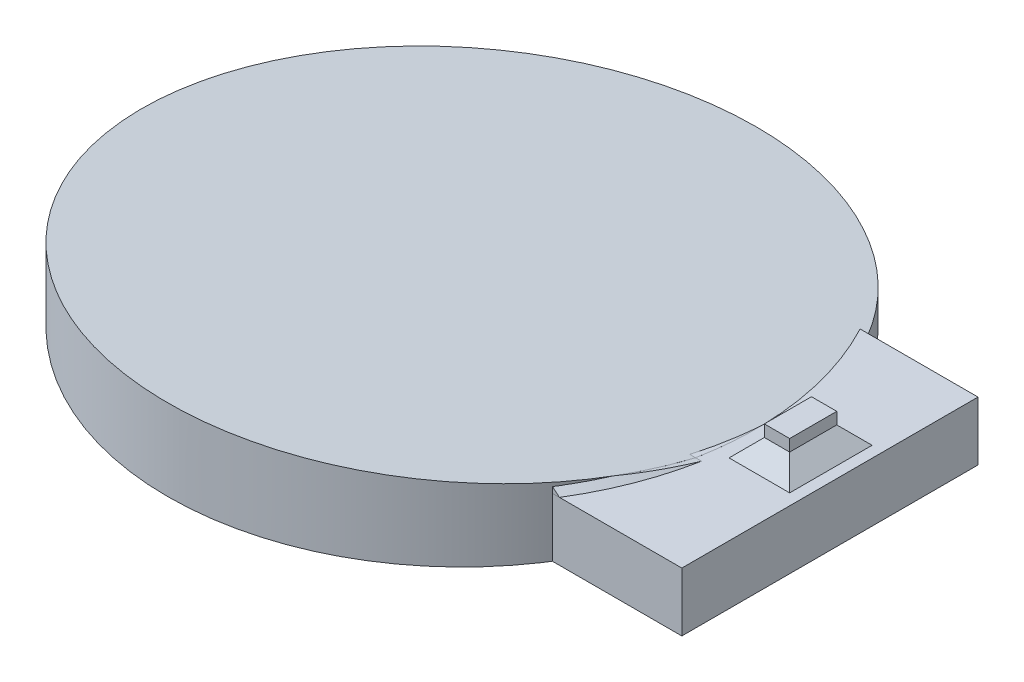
ISO-10303-21;
HEADER;
FILE_DESCRIPTION(('STEP AP214'),'2;1');
FILE_NAME('part.step','',(''),(''),'','','');
FILE_SCHEMA(('AUTOMOTIVE_DESIGN { 1 0 10303 214 1 1 1 1 }'));
ENDSEC;
DATA;
#1=APPLICATION_CONTEXT('core data for automotive mechanical design processes');
#2=APPLICATION_PROTOCOL_DEFINITION('international standard','automotive_design',2000,#1);
#3=PRODUCT_CONTEXT('',#1,'mechanical');
#4=PRODUCT('Part','Part','',(#3));
#5=PRODUCT_RELATED_PRODUCT_CATEGORY('part','',(#4));
#6=PRODUCT_DEFINITION_FORMATION('','',#4);
#7=PRODUCT_DEFINITION_CONTEXT('part definition',#1,'design');
#8=PRODUCT_DEFINITION('design','',#6,#7);
#9=PRODUCT_DEFINITION_SHAPE('','',#8);
#10=(LENGTH_UNIT() NAMED_UNIT(*) SI_UNIT(.MILLI.,.METRE.));
#11=(NAMED_UNIT(*) PLANE_ANGLE_UNIT() SI_UNIT($,.RADIAN.));
#12=(NAMED_UNIT(*) SI_UNIT($,.STERADIAN.) SOLID_ANGLE_UNIT());
#13=UNCERTAINTY_MEASURE_WITH_UNIT(LENGTH_MEASURE(1.E-05),#10,'distance_accuracy_value','');
#14=(GEOMETRIC_REPRESENTATION_CONTEXT(3) GLOBAL_UNCERTAINTY_ASSIGNED_CONTEXT((#13)) GLOBAL_UNIT_ASSIGNED_CONTEXT((#10,
#11,#12)) REPRESENTATION_CONTEXT('',''));
#15=CARTESIAN_POINT('',(0.,0.,0.));
#16=DIRECTION('',(0.,0.,1.));
#17=DIRECTION('',(1.,0.,0.));
#18=AXIS2_PLACEMENT_3D('',#15,#16,#17);
#19=CARTESIAN_POINT('',(177.768283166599,13.801824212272,50.));
#20=DIRECTION('',(0.,0.995639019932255,-0.0932895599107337));
#21=DIRECTION('',(0.,0.0932895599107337,0.995639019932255));
#22=AXIS2_PLACEMENT_3D('',#19,#20,#21);
#23=PLANE('',#22);
#24=DIRECTION('',(1.,0.,0.));
#25=VECTOR('',#24,1.);
#26=CARTESIAN_POINT('',(177.768283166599,10.,9.42477876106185));
#27=LINE('',#26,#25);
#28=CARTESIAN_POINT('',(49.1037019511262,10.,9.42477876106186));
#29=VERTEX_POINT('',#28);
#30=CARTESIAN_POINT('',(50.1215876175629,10.,9.42477876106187));
#31=VERTEX_POINT('',#30);
#32=EDGE_CURVE('E66',#29,#31,#27,.T.);
#33=ORIENTED_EDGE('',*,*,#32,.F.);
#34=CARTESIAN_POINT('',(0.,9.11691542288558,0.));
#35=DIRECTION('',(0.,0.995639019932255,-0.0932895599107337));
#36=DIRECTION('',(0.,-0.0932895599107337,-0.995639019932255));
#37=AXIS2_PLACEMENT_3D('',#34,#35,#36);
#38=ELLIPSE('',#37,50.2190040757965,50.);
#39=CARTESIAN_POINT('',(45.7831488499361,11.,20.0973451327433));
#40=VERTEX_POINT('',#39);
#41=EDGE_CURVE('E79',#40,#29,#38,.T.);
#42=ORIENTED_EDGE('',*,*,#41,.F.);
#43=CARTESIAN_POINT('',(0.,8.65738135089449,-4.90440788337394));
#44=DIRECTION('',(0.,0.995639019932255,-0.0932895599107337));
#45=DIRECTION('',(0.,-0.0932895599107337,-0.995639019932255));
#46=AXIS2_PLACEMENT_3D('',#43,#44,#45);
#47=ELLIPSE('',#46,52.5718835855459,52.1123450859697);
#48=EDGE_CURVE('E12',#40,#31,#47,.T.);
#49=ORIENTED_EDGE('',*,*,#48,.T.);
#50=EDGE_LOOP('',(#33,#42,#49));
#51=FACE_BOUND('',#50,.T.);
#52=ADVANCED_FACE('F44',(#51),#23,.T.);
#53=CARTESIAN_POINT('',(64.1693493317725,10.,26.8266510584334));
#54=DIRECTION('',(0.,0.,-1.));
#55=DIRECTION('',(-1.,0.,0.));
#56=AXIS2_PLACEMENT_3D('',#53,#54,#55);
#57=PLANE('',#56);
#58=DIRECTION('',(0.,-1.,0.));
#59=VECTOR('',#58,1.);
#60=CARTESIAN_POINT('',(42.1939663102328,15.,26.8266510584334));
#61=LINE('',#60,#59);
#62=CARTESIAN_POINT('',(42.1939663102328,10.,26.8266510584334));
#63=VERTEX_POINT('',#62);
#64=CARTESIAN_POINT('',(42.1939663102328,11.,26.8266510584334));
#65=VERTEX_POINT('',#64);
#66=EDGE_CURVE('E58',#63,#65,#61,.F.);
#67=ORIENTED_EDGE('',*,*,#66,.F.);
#68=DIRECTION('',(1.,0.,0.));
#69=VECTOR('',#68,1.);
#70=CARTESIAN_POINT('',(64.1693493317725,10.,26.8266510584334));
#71=LINE('',#70,#69);
#72=CARTESIAN_POINT('',(43.3743102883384,10.,26.8266510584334));
#73=VERTEX_POINT('',#72);
#74=EDGE_CURVE('E80',#63,#73,#71,.T.);
#75=ORIENTED_EDGE('',*,*,#74,.T.);
#76=CARTESIAN_POINT('',(43.3743102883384,10.,26.8266510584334));
#77=CARTESIAN_POINT('',(43.1779063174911,10.1670444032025,26.8266510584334));
#78=CARTESIAN_POINT('',(42.9813423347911,10.3338999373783,26.8266510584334));
#79=CARTESIAN_POINT('',(42.587894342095,10.6672332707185,26.8266510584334));
#80=CARTESIAN_POINT('',(42.3910103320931,10.8337110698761,26.8266510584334));
#81=CARTESIAN_POINT('',(42.1939663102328,11.,26.8266510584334));
#82=B_SPLINE_CURVE_WITH_KNOTS('',3,(#76,#77,#78,#79,#80,#81),.UNSPECIFIED.,.F.,.F.,(4,2,4),(0.,
0.773500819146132,1.54700165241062),.UNSPECIFIED.);
#83=EDGE_CURVE('E51',#73,#65,#82,.T.);
#84=ORIENTED_EDGE('',*,*,#83,.T.);
#85=EDGE_LOOP('',(#67,#75,#84));
#86=FACE_BOUND('',#85,.T.);
#87=ADVANCED_FACE('F89',(#86),#57,.F.);
#88=CARTESIAN_POINT('',(0.,10.,0.));
#89=DIRECTION('',(0.,-1.,0.));
#90=DIRECTION('',(0.,0.,-1.));
#91=AXIS2_PLACEMENT_3D('',#88,#89,#90);
#92=CONICAL_SURFACE('',#91,51.,0.785398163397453);
#93=ORIENTED_EDGE('',*,*,#48,.F.);
#94=CARTESIAN_POINT('',(0.,11.,0.));
#95=DIRECTION('',(0.,1.,0.));
#96=DIRECTION('',(0.,0.,1.));
#97=AXIS2_PLACEMENT_3D('',#94,#95,#96);
#98=CIRCLE('',#97,50.);
#99=EDGE_CURVE('E96',#65,#40,#98,.T.);
#100=ORIENTED_EDGE('',*,*,#99,.F.);
#101=ORIENTED_EDGE('',*,*,#83,.F.);
#102=CARTESIAN_POINT('',(0.,10.,0.));
#103=DIRECTION('',(0.,1.,0.));
#104=DIRECTION('',(0.,0.,1.));
#105=AXIS2_PLACEMENT_3D('',#102,#103,#104);
#106=CIRCLE('',#105,51.);
#107=EDGE_CURVE('E85',#31,#73,#106,.F.);
#108=ORIENTED_EDGE('',*,*,#107,.F.);
#109=EDGE_LOOP('',(#93,#100,#101,#108));
#110=FACE_BOUND('',#109,.T.);
#111=ADVANCED_FACE('F102',(#110),#92,.T.);
#112=CARTESIAN_POINT('',(0.,15.,0.));
#113=DIRECTION('',(0.,-1.,0.));
#114=DIRECTION('',(0.,0.,-1.));
#115=AXIS2_PLACEMENT_3D('',#112,#113,#114);
#116=CYLINDRICAL_SURFACE('',#115,50.);
#117=ORIENTED_EDGE('',*,*,#66,.T.);
#118=ORIENTED_EDGE('',*,*,#99,.T.);
#119=ORIENTED_EDGE('',*,*,#41,.T.);
#120=CARTESIAN_POINT('',(0.,10.,0.));
#121=DIRECTION('',(0.,1.,0.));
#122=DIRECTION('',(0.,0.,1.));
#123=AXIS2_PLACEMENT_3D('',#120,#121,#122);
#124=CIRCLE('',#123,50.);
#125=EDGE_CURVE('E75',#29,#63,#124,.F.);
#126=ORIENTED_EDGE('',*,*,#125,.T.);
#127=EDGE_LOOP('',(#117,#118,#119,#126));
#128=FACE_BOUND('',#127,.T.);
#129=ADVANCED_FACE('F77',(#128),#116,.F.);
#130=CARTESIAN_POINT('',(0.,10.,0.));
#131=DIRECTION('',(0.,1.,0.));
#132=DIRECTION('',(0.,0.,1.));
#133=AXIS2_PLACEMENT_3D('',#130,#131,#132);
#134=PLANE('',#133);
#135=ORIENTED_EDGE('',*,*,#32,.T.);
#136=ORIENTED_EDGE('',*,*,#107,.T.);
#137=ORIENTED_EDGE('',*,*,#74,.F.);
#138=ORIENTED_EDGE('',*,*,#125,.F.);
#139=EDGE_LOOP('',(#135,#136,#137,#138));
#140=FACE_BOUND('',#139,.T.);
#141=ADVANCED_FACE('F83',(#140),#134,.F.);
#142=CLOSED_SHELL('',(#52,#87,#111,#129,#141));
#143=MANIFOLD_SOLID_BREP('B2',#142);
#144=CARTESIAN_POINT('',(64.1693493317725,10.,-23.5001463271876));
#145=DIRECTION('',(0.,0.,1.));
#146=DIRECTION('',(1.,0.,0.));
#147=AXIS2_PLACEMENT_3D('',#144,#145,#146);
#148=PLANE('',#147);
#149=DIRECTION('',(0.,-1.,0.));
#150=VECTOR('',#149,1.);
#151=CARTESIAN_POINT('',(44.1332428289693,10.,-23.5001463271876));
#152=LINE('',#151,#150);
#153=CARTESIAN_POINT('',(44.1332428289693,7.94583982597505,-23.5001463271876));
#154=VERTEX_POINT('',#153);
#155=CARTESIAN_POINT('',(44.1332428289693,6.91499458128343,-23.5001463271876));
#156=VERTEX_POINT('',#155);
#157=EDGE_CURVE('E175',#154,#156,#152,.T.);
#158=ORIENTED_EDGE('',*,*,#157,.T.);
#159=DIRECTION('',(1.,0.,0.));
#160=VECTOR('',#159,1.);
#161=CARTESIAN_POINT('',(177.768283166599,6.91499458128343,-23.5001463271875));
#162=LINE('',#161,#160);
#163=CARTESIAN_POINT('',(42.9671919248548,6.91486611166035,-23.5015174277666));
#164=VERTEX_POINT('',#163);
#165=EDGE_CURVE('E207',#164,#156,#162,.T.);
#166=ORIENTED_EDGE('',*,*,#165,.F.);
#167=CARTESIAN_POINT('',(44.139200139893,7.94803674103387,-23.5001463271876));
#168=CARTESIAN_POINT('',(44.0903029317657,7.90499042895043,-23.5007119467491));
#169=CARTESIAN_POINT('',(44.0414097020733,7.8619386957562,-23.5012089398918));
#170=CARTESIAN_POINT('',(43.9436459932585,7.77583713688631,-23.5020655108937));
#171=CARTESIAN_POINT('',(43.8947755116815,7.73278731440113,-23.5024251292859));
#172=CARTESIAN_POINT('',(43.797057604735,7.64668958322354,-23.5030070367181));
#173=CARTESIAN_POINT('',(43.7482101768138,7.60364167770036,-23.5032293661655));
#174=CARTESIAN_POINT('',(43.6505386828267,7.51754778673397,-23.5035367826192));
#175=CARTESIAN_POINT('',(43.6017146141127,7.47450180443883,-23.5036219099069));
#176=CARTESIAN_POINT('',(43.5040901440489,7.38841176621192,-23.5036550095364));
#177=CARTESIAN_POINT('',(43.4552897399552,7.34536771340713,-23.5036030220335));
#178=CARTESIAN_POINT('',(43.3577129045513,7.25928154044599,-23.5033619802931));
#179=CARTESIAN_POINT('',(43.308936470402,7.21623942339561,-23.5031729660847));
#180=CARTESIAN_POINT('',(43.2114078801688,7.13015712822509,-23.5026579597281));
#181=CARTESIAN_POINT('',(43.1626557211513,7.08711695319,-23.5023320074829));
#182=CARTESIAN_POINT('',(43.0651759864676,7.00103854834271,-23.5015432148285));
#183=CARTESIAN_POINT('',(43.0164484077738,6.95800032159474,-23.5010804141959));
#184=CARTESIAN_POINT('',(42.9677262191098,6.91495683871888,-23.5005491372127));
#185=B_SPLINE_CURVE_WITH_KNOTS('',3,(#167,#168,#169,#170,#171,#172,#173,#174,#175,#176,#177,
#178,#179,#180,#181,#182,#183,#184),.UNSPECIFIED.,.F.,.F.,(4,2,2,2,2,2,2,2,4),(0.,
0.195443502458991,0.390829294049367,0.586157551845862,0.781428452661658,0.976642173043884,
1.17179888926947,1.36689877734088,1.56194201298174),.UNSPECIFIED.);
#186=EDGE_CURVE('E168',#164,#154,#185,.F.);
#187=ORIENTED_EDGE('',*,*,#186,.T.);
#188=EDGE_LOOP('',(#158,#166,#187));
#189=FACE_BOUND('',#188,.T.);
#190=ADVANCED_FACE('F157',(#189),#148,.F.);
#191=CARTESIAN_POINT('',(0.,10.,0.));
#192=DIRECTION('',(0.,1.,0.));
#193=DIRECTION('',(0.,0.,1.));
#194=AXIS2_PLACEMENT_3D('',#191,#192,#193);
#195=PLANE('',#194);
#196=DIRECTION('',(-1.,0.,0.));
#197=VECTOR('',#196,1.);
#198=CARTESIAN_POINT('',(0.,10.,9.42477876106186));
#199=LINE('',#198,#197);
#200=CARTESIAN_POINT('',(49.1037019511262,10.,9.42477876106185));
#201=VERTEX_POINT('',#200);
#202=CARTESIAN_POINT('',(48.1218807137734,10.0000864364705,9.42570126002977));
#203=VERTEX_POINT('',#202);
#204=EDGE_CURVE('E183',#201,#203,#199,.T.);
#205=ORIENTED_EDGE('',*,*,#204,.F.);
#206=CARTESIAN_POINT('',(0.,10.,0.));
#207=DIRECTION('',(0.,1.,0.));
#208=DIRECTION('',(0.,0.,1.));
#209=AXIS2_PLACEMENT_3D('',#206,#207,#208);
#210=CIRCLE('',#209,50.);
#211=CARTESIAN_POINT('',(49.9863240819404,10.,-1.16936084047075));
#212=VERTEX_POINT('',#211);
#213=EDGE_CURVE('E197',#212,#201,#210,.F.);
#214=ORIENTED_EDGE('',*,*,#213,.F.);
#215=CARTESIAN_POINT('',(48.1218822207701,10.0000857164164,9.4256935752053));
#216=CARTESIAN_POINT('',(48.2469062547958,10.0005990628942,8.99808269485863));
#217=CARTESIAN_POINT('',(48.3659370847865,10.0010084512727,8.56872311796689));
#218=CARTESIAN_POINT('',(48.5922828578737,10.0016500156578,7.70593175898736));
#219=CARTESIAN_POINT('',(48.6995718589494,10.0018818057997,7.27249316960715));
#220=CARTESIAN_POINT('',(48.9023915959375,10.002197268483,6.40184330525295));
#221=CARTESIAN_POINT('',(48.9978952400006,10.0022806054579,5.96462572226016));
#222=CARTESIAN_POINT('',(49.1771041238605,10.0023281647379,5.08671825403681));
#223=CARTESIAN_POINT('',(49.2607813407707,10.0022921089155,4.64602265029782));
#224=CARTESIAN_POINT('',(49.4162969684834,10.0021299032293,3.76146316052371));
#225=CARTESIAN_POINT('',(49.4881066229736,10.0020035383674,3.31759422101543));
#226=CARTESIAN_POINT('',(49.6198471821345,10.0016897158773,2.42699485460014));
#227=CARTESIAN_POINT('',(49.6797487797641,10.0015021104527,1.9802600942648));
#228=CARTESIAN_POINT('',(49.7876334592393,10.0010948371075,1.08423944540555));
#229=CARTESIAN_POINT('',(49.8355868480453,10.0008750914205,0.634949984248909));
#230=CARTESIAN_POINT('',(49.91953602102,10.0004324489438,-0.265868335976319));
#231=CARTESIAN_POINT('',(49.9555018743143,10.0002095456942,-0.717399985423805));
#232=CARTESIAN_POINT('',(49.9854317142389,10.,-1.16932908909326));
#233=B_SPLINE_CURVE_WITH_KNOTS('',3,(#215,#216,#217,#218,#219,#220,#221,#222,#223,#224,#225,
#226,#227,#228,#229,#230,#231,#232),.UNSPECIFIED.,.F.,.F.,(4,2,2,2,2,2,2,2,4),(0.,
1.3364918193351,2.67587924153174,4.01829041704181,5.36383095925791,6.71258553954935,
8.06461954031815,9.41998076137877,10.7787011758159),.UNSPECIFIED.);
#234=EDGE_CURVE('E42',#212,#203,#233,.F.);
#235=ORIENTED_EDGE('',*,*,#234,.T.);
#236=EDGE_LOOP('',(#205,#214,#235));
#237=FACE_BOUND('',#236,.T.);
#238=ADVANCED_FACE('F159',(#237),#195,.T.);
#239=CARTESIAN_POINT('',(47.7644780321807,10.1558328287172,11.0879149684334));
#240=CARTESIAN_POINT('',(50.6104779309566,9.01693759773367,-1.06701997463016));
#241=CARTESIAN_POINT('',(48.5430461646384,7.77961594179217,-14.2724174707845));
#242=CARTESIAN_POINT('',(42.118336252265,6.77671598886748,-24.9759337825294));
#243=CARTESIAN_POINT('',(48.7255108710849,11.1377022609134,11.2171560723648));
#244=CARTESIAN_POINT('',(51.6287729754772,9.99880702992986,-1.18233909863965));
#245=CARTESIAN_POINT('',(49.519743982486,8.76148537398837,-14.6534323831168));
#246=CARTESIAN_POINT('',(42.9657673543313,7.75858542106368,-25.5723060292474));
#247=B_SPLINE_SURFACE_WITH_KNOTS('',1,3,((#239,#240,#241,#242),(#243,#244,#245,#246)),
.UNSPECIFIED.,.F.,.F.,.F.,(2,2),(4,4),(0.,1.),(4.48612005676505,5.24925580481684),.UNSPECIFIED.);
#248=CARTESIAN_POINT('',(48.7255108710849,11.1377022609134,11.2171560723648));
#249=CARTESIAN_POINT('',(51.6287729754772,9.99880702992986,-1.18233909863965));
#250=CARTESIAN_POINT('',(49.519743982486,8.76148537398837,-14.6534323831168));
#251=CARTESIAN_POINT('',(42.9657673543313,7.75858542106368,-25.5723060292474));
#252=B_SPLINE_CURVE_WITH_KNOTS('',3,(#248,#249,#250,#251),.UNSPECIFIED.,.F.,.F.,(4,4),
(4.48612005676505,5.24925580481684),.UNSPECIFIED.);
#253=CARTESIAN_POINT('',(47.774298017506,8.75328664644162,-14.751828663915));
#254=VERTEX_POINT('',#253);
#255=EDGE_CURVE('E200',#254,#212,#252,.F.);
#256=CARTESIAN_POINT('',(48.7255108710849,11.1377022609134,11.2171560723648));
#257=CARTESIAN_POINT('',(51.6287729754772,9.99880702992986,-1.18233909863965));
#258=CARTESIAN_POINT('',(49.519743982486,8.76148537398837,-14.6534323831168));
#259=CARTESIAN_POINT('',(42.9657673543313,7.75858542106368,-25.5723060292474));
#260=B_SPLINE_CURVE_WITH_KNOTS('',3,(#256,#257,#258,#259),.UNSPECIFIED.,.F.,.F.,(4,4),
(4.48612005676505,5.24925580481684),.UNSPECIFIED.);
#261=EDGE_CURVE('E270',#154,#254,#260,.F.);
#262=CARTESIAN_POINT('',(42.118336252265,6.77671598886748,-24.9759337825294));
#263=CARTESIAN_POINT('',(48.5430461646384,7.77961594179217,-14.2724174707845));
#264=CARTESIAN_POINT('',(50.6104779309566,9.01693759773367,-1.06701997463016));
#265=CARTESIAN_POINT('',(47.7644780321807,10.1558328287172,11.0879149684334));
#266=B_SPLINE_CURVE_WITH_KNOTS('',3,(#262,#263,#264,#265),.UNSPECIFIED.,.F.,.F.,(4,4),
(4.48612005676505,5.24925580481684),.UNSPECIFIED.);
#267=EDGE_CURVE('E211',#203,#164,#266,.F.);
#268=ORIENTED_EDGE('',*,*,#234,.F.);
#269=ORIENTED_EDGE('',*,*,#255,.F.);
#270=ORIENTED_EDGE('',*,*,#261,.F.);
#271=ORIENTED_EDGE('',*,*,#186,.F.);
#272=ORIENTED_EDGE('',*,*,#267,.F.);
#273=EDGE_LOOP('',(#268,#269,#270,#271,#272));
#274=FACE_BOUND('',#273,.T.);
#275=ADVANCED_FACE('F236',(#274),#247,.T.);
#276=CARTESIAN_POINT('',(0.,10.,0.));
#277=DIRECTION('',(0.,-1.,0.));
#278=DIRECTION('',(0.,0.,-1.));
#279=AXIS2_PLACEMENT_3D('',#276,#277,#278);
#280=CYLINDRICAL_SURFACE('',#279,50.);
#281=ORIENTED_EDGE('',*,*,#255,.T.);
#282=ORIENTED_EDGE('',*,*,#213,.T.);
#283=CARTESIAN_POINT('',(0.,9.11691542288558,0.));
#284=DIRECTION('',(0.,0.995639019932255,-0.0932895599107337));
#285=DIRECTION('',(0.,-0.0932895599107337,-0.995639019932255));
#286=AXIS2_PLACEMENT_3D('',#283,#284,#285);
#287=ELLIPSE('',#286,50.2190040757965,50.);
#288=EDGE_CURVE('E199',#201,#156,#287,.T.);
#289=ORIENTED_EDGE('',*,*,#288,.T.);
#290=ORIENTED_EDGE('',*,*,#157,.F.);
#291=ORIENTED_EDGE('',*,*,#261,.T.);
#292=EDGE_LOOP('',(#281,#282,#289,#290,#291));
#293=FACE_BOUND('',#292,.T.);
#294=ADVANCED_FACE('F198',(#293),#280,.T.);
#295=CARTESIAN_POINT('',(177.768283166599,13.801824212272,50.));
#296=DIRECTION('',(0.,0.995639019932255,-0.0932895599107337));
#297=DIRECTION('',(0.,0.0932895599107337,0.995639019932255));
#298=AXIS2_PLACEMENT_3D('',#295,#296,#297);
#299=PLANE('',#298);
#300=ORIENTED_EDGE('',*,*,#288,.F.);
#301=ORIENTED_EDGE('',*,*,#204,.T.);
#302=ORIENTED_EDGE('',*,*,#267,.T.);
#303=ORIENTED_EDGE('',*,*,#165,.T.);
#304=EDGE_LOOP('',(#300,#301,#302,#303));
#305=FACE_BOUND('',#304,.T.);
#306=ADVANCED_FACE('F205',(#305),#299,.F.);
#307=CLOSED_SHELL('',(#190,#238,#275,#294,#306));
#308=MANIFOLD_SOLID_BREP('B6',#307);
#309=CARTESIAN_POINT('',(51.9713163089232,10.,0.));
#310=DIRECTION('',(0.707106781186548,-0.707106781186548,0.));
#311=DIRECTION('',(0.707106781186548,0.707106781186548,0.));
#312=AXIS2_PLACEMENT_3D('',#309,#310,#311);
#313=PLANE('',#312);
#314=DIRECTION('',(-0.577350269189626,-0.577350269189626,0.577350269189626));
#315=VECTOR('',#314,1.);
#316=CARTESIAN_POINT('',(34.6475442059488,-7.32377210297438,23.9273230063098));
#317=LINE('',#316,#315);
#318=CARTESIAN_POINT('',(54.9713163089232,13.,3.60355090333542));
#319=VERTEX_POINT('',#318);
#320=CARTESIAN_POINT('',(51.9713163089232,10.,6.60355090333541));
#321=VERTEX_POINT('',#320);
#322=EDGE_CURVE('E459',#319,#321,#317,.T.);
#323=ORIENTED_EDGE('',*,*,#322,.F.);
#324=DIRECTION('',(0.,0.,1.));
#325=VECTOR('',#324,1.);
#326=CARTESIAN_POINT('',(54.9713163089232,13.,3.60355090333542));
#327=LINE('',#326,#325);
#328=CARTESIAN_POINT('',(54.9713163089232,13.,-4.40214039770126));
#329=VERTEX_POINT('',#328);
#330=EDGE_CURVE('E380',#329,#319,#327,.T.);
#331=ORIENTED_EDGE('',*,*,#330,.F.);
#332=DIRECTION('',(-0.577350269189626,-0.577350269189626,-0.577350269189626));
#333=VECTOR('',#332,1.);
#334=CARTESIAN_POINT('',(54.4386964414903,12.4673801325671,-4.93476026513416));
#335=LINE('',#334,#333);
#336=CARTESIAN_POINT('',(51.9713163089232,10.,-7.40214039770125));
#337=VERTEX_POINT('',#336);
#338=EDGE_CURVE('E462',#337,#329,#335,.F.);
#339=ORIENTED_EDGE('',*,*,#338,.F.);
#340=DIRECTION('',(0.,0.,-1.));
#341=VECTOR('',#340,1.);
#342=CARTESIAN_POINT('',(51.9713163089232,10.,0.));
#343=LINE('',#342,#341);
#344=EDGE_CURVE('E467',#321,#337,#343,.T.);
#345=ORIENTED_EDGE('',*,*,#344,.F.);
#346=EDGE_LOOP('',(#323,#331,#339,#345));
#347=FACE_BOUND('',#346,.T.);
#348=ADVANCED_FACE('F373',(#347),#313,.F.);
#349=CARTESIAN_POINT('',(0.,10.,-7.40214039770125));
#350=DIRECTION('',(0.,-0.707106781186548,0.707106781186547));
#351=DIRECTION('',(0.,-0.707106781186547,-0.707106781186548));
#352=AXIS2_PLACEMENT_3D('',#349,#350,#351);
#353=PLANE('',#352);
#354=ORIENTED_EDGE('',*,*,#338,.T.);
#355=DIRECTION('',(-1.,0.,0.));
#356=VECTOR('',#355,1.);
#357=CARTESIAN_POINT('',(54.9713163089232,13.,-4.40214039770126));
#358=LINE('',#357,#356);
#359=CARTESIAN_POINT('',(59.2700852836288,13.,-4.40214039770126));
#360=VERTEX_POINT('',#359);
#361=EDGE_CURVE('E474',#360,#329,#358,.T.);
#362=ORIENTED_EDGE('',*,*,#361,.F.);
#363=DIRECTION('',(0.577350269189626,-0.577350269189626,-0.577350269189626));
#364=VECTOR('',#363,1.);
#365=CARTESIAN_POINT('',(41.5133901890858,30.7566950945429,13.3545546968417));
#366=LINE('',#365,#364);
#367=CARTESIAN_POINT('',(62.2700852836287,10.,-7.40214039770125));
#368=VERTEX_POINT('',#367);
#369=EDGE_CURVE('E456',#368,#360,#366,.F.);
#370=ORIENTED_EDGE('',*,*,#369,.F.);
#371=DIRECTION('',(1.,0.,0.));
#372=VECTOR('',#371,1.);
#373=CARTESIAN_POINT('',(0.,10.,-7.40214039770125));
#374=LINE('',#373,#372);
#375=EDGE_CURVE('E394',#337,#368,#374,.T.);
#376=ORIENTED_EDGE('',*,*,#375,.F.);
#377=EDGE_LOOP('',(#354,#362,#370,#376));
#378=FACE_BOUND('',#377,.T.);
#379=ADVANCED_FACE('F494',(#378),#353,.F.);
#380=CARTESIAN_POINT('',(0.,10.,6.60355090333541));
#381=DIRECTION('',(0.,-0.707106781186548,-0.707106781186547));
#382=DIRECTION('',(0.,0.707106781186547,-0.707106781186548));
#383=AXIS2_PLACEMENT_3D('',#380,#381,#382);
#384=PLANE('',#383);
#385=ORIENTED_EDGE('',*,*,#322,.T.);
#386=DIRECTION('',(-1.,0.,0.));
#387=VECTOR('',#386,1.);
#388=CARTESIAN_POINT('',(0.,10.,6.60355090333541));
#389=LINE('',#388,#387);
#390=CARTESIAN_POINT('',(62.2700852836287,10.,6.60355090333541));
#391=VERTEX_POINT('',#390);
#392=EDGE_CURVE('E465',#391,#321,#389,.T.);
#393=ORIENTED_EDGE('',*,*,#392,.F.);
#394=DIRECTION('',(-0.577350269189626,0.577350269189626,-0.577350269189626));
#395=VECTOR('',#394,1.);
#396=CARTESIAN_POINT('',(41.5133901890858,30.7566950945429,-14.1531441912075));
#397=LINE('',#396,#395);
#398=CARTESIAN_POINT('',(59.2700852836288,13.,3.60355090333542));
#399=VERTEX_POINT('',#398);
#400=EDGE_CURVE('E453',#399,#391,#397,.F.);
#401=ORIENTED_EDGE('',*,*,#400,.F.);
#402=DIRECTION('',(1.,0.,0.));
#403=VECTOR('',#402,1.);
#404=CARTESIAN_POINT('',(54.9713163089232,13.,3.60355090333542));
#405=LINE('',#404,#403);
#406=EDGE_CURVE('E155',#319,#399,#405,.T.);
#407=ORIENTED_EDGE('',*,*,#406,.F.);
#408=EDGE_LOOP('',(#385,#393,#401,#407));
#409=FACE_BOUND('',#408,.T.);
#410=ADVANCED_FACE('F486',(#409),#384,.F.);
#411=CARTESIAN_POINT('',(62.2700852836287,10.,0.));
#412=DIRECTION('',(-0.707106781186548,-0.707106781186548,0.));
#413=DIRECTION('',(0.707106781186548,-0.707106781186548,0.));
#414=AXIS2_PLACEMENT_3D('',#411,#412,#413);
#415=PLANE('',#414);
#416=ORIENTED_EDGE('',*,*,#369,.T.);
#417=DIRECTION('',(0.,0.,-1.));
#418=VECTOR('',#417,1.);
#419=CARTESIAN_POINT('',(59.2700852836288,13.,3.60355090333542));
#420=LINE('',#419,#418);
#421=EDGE_CURVE('E472',#399,#360,#420,.T.);
#422=ORIENTED_EDGE('',*,*,#421,.F.);
#423=ORIENTED_EDGE('',*,*,#400,.T.);
#424=DIRECTION('',(0.,0.,1.));
#425=VECTOR('',#424,1.);
#426=CARTESIAN_POINT('',(62.2700852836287,10.,0.));
#427=LINE('',#426,#425);
#428=EDGE_CURVE('E470',#368,#391,#427,.T.);
#429=ORIENTED_EDGE('',*,*,#428,.F.);
#430=EDGE_LOOP('',(#416,#422,#423,#429));
#431=FACE_BOUND('',#430,.T.);
#432=ADVANCED_FACE('F489',(#431),#415,.F.);
#433=CARTESIAN_POINT('',(54.9713163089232,15.,3.60355090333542));
#434=DIRECTION('',(1.,0.,0.));
#435=DIRECTION('',(0.,0.,-1.));
#436=AXIS2_PLACEMENT_3D('',#433,#434,#435);
#437=PLANE('',#436);
#438=ORIENTED_EDGE('',*,*,#330,.T.);
#439=DIRECTION('',(0.,-1.,0.));
#440=VECTOR('',#439,1.);
#441=CARTESIAN_POINT('',(54.9713163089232,15.,3.60355090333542));
#442=LINE('',#441,#440);
#443=CARTESIAN_POINT('',(54.9713163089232,10.,3.60355090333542));
#444=VERTEX_POINT('',#443);
#445=EDGE_CURVE('E429',#319,#444,#442,.T.);
#446=ORIENTED_EDGE('',*,*,#445,.T.);
#447=DIRECTION('',(0.,0.,-1.));
#448=VECTOR('',#447,1.);
#449=CARTESIAN_POINT('',(54.9713163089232,10.,0.));
#450=LINE('',#449,#448);
#451=CARTESIAN_POINT('',(54.9713163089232,10.,-4.40214039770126));
#452=VERTEX_POINT('',#451);
#453=EDGE_CURVE('E440',#444,#452,#450,.T.);
#454=ORIENTED_EDGE('',*,*,#453,.T.);
#455=DIRECTION('',(0.,-1.,0.));
#456=VECTOR('',#455,1.);
#457=CARTESIAN_POINT('',(54.9713163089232,15.,-4.40214039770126));
#458=LINE('',#457,#456);
#459=EDGE_CURVE('E450',#329,#452,#458,.T.);
#460=ORIENTED_EDGE('',*,*,#459,.F.);
#461=EDGE_LOOP('',(#438,#446,#454,#460));
#462=FACE_BOUND('',#461,.T.);
#463=ADVANCED_FACE('F478',(#462),#437,.T.);
#464=CARTESIAN_POINT('',(54.9713163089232,15.,-4.40214039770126));
#465=DIRECTION('',(0.,0.,1.));
#466=DIRECTION('',(1.,0.,0.));
#467=AXIS2_PLACEMENT_3D('',#464,#465,#466);
#468=PLANE('',#467);
#469=ORIENTED_EDGE('',*,*,#361,.T.);
#470=ORIENTED_EDGE('',*,*,#459,.T.);
#471=DIRECTION('',(1.,0.,0.));
#472=VECTOR('',#471,1.);
#473=CARTESIAN_POINT('',(0.,10.,-4.40214039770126));
#474=LINE('',#473,#472);
#475=CARTESIAN_POINT('',(59.2700852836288,10.,-4.40214039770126));
#476=VERTEX_POINT('',#475);
#477=EDGE_CURVE('E444',#452,#476,#474,.T.);
#478=ORIENTED_EDGE('',*,*,#477,.T.);
#479=DIRECTION('',(0.,-1.,0.));
#480=VECTOR('',#479,1.);
#481=CARTESIAN_POINT('',(59.2700852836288,15.,-4.40214039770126));
#482=LINE('',#481,#480);
#483=EDGE_CURVE('E430',#360,#476,#482,.T.);
#484=ORIENTED_EDGE('',*,*,#483,.F.);
#485=EDGE_LOOP('',(#469,#470,#478,#484));
#486=FACE_BOUND('',#485,.T.);
#487=ADVANCED_FACE('F492',(#486),#468,.T.);
#488=CARTESIAN_POINT('',(54.9713163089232,15.,3.60355090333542));
#489=DIRECTION('',(0.,0.,-1.));
#490=DIRECTION('',(-1.,0.,0.));
#491=AXIS2_PLACEMENT_3D('',#488,#489,#490);
#492=PLANE('',#491);
#493=ORIENTED_EDGE('',*,*,#406,.T.);
#494=DIRECTION('',(0.,-1.,0.));
#495=VECTOR('',#494,1.);
#496=CARTESIAN_POINT('',(59.2700852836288,15.,3.60355090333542));
#497=LINE('',#496,#495);
#498=CARTESIAN_POINT('',(59.2700852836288,10.,3.60355090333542));
#499=VERTEX_POINT('',#498);
#500=EDGE_CURVE('E387',#399,#499,#497,.T.);
#501=ORIENTED_EDGE('',*,*,#500,.T.);
#502=DIRECTION('',(-1.,0.,0.));
#503=VECTOR('',#502,1.);
#504=CARTESIAN_POINT('',(0.,10.,3.60355090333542));
#505=LINE('',#504,#503);
#506=EDGE_CURVE('E426',#499,#444,#505,.T.);
#507=ORIENTED_EDGE('',*,*,#506,.T.);
#508=ORIENTED_EDGE('',*,*,#445,.F.);
#509=EDGE_LOOP('',(#493,#501,#507,#508));
#510=FACE_BOUND('',#509,.T.);
#511=ADVANCED_FACE('F424',(#510),#492,.T.);
#512=CARTESIAN_POINT('',(0.,10.,0.));
#513=DIRECTION('',(0.,1.,0.));
#514=DIRECTION('',(0.,0.,1.));
#515=AXIS2_PLACEMENT_3D('',#512,#513,#514);
#516=PLANE('',#515);
#517=ORIENTED_EDGE('',*,*,#506,.F.);
#518=DIRECTION('',(0.,0.,1.));
#519=VECTOR('',#518,1.);
#520=CARTESIAN_POINT('',(59.2700852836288,10.,0.));
#521=LINE('',#520,#519);
#522=EDGE_CURVE('E437',#476,#499,#521,.T.);
#523=ORIENTED_EDGE('',*,*,#522,.F.);
#524=ORIENTED_EDGE('',*,*,#477,.F.);
#525=ORIENTED_EDGE('',*,*,#453,.F.);
#526=EDGE_LOOP('',(#517,#523,#524,#525));
#527=FACE_BOUND('',#526,.T.);
#528=ORIENTED_EDGE('',*,*,#375,.T.);
#529=ORIENTED_EDGE('',*,*,#428,.T.);
#530=ORIENTED_EDGE('',*,*,#392,.T.);
#531=ORIENTED_EDGE('',*,*,#344,.T.);
#532=EDGE_LOOP('',(#528,#529,#530,#531));
#533=FACE_BOUND('',#532,.T.);
#534=ADVANCED_FACE('F435',(#527,#533),#516,.F.);
#535=CARTESIAN_POINT('',(59.2700852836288,15.,3.60355090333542));
#536=DIRECTION('',(-1.,0.,0.));
#537=DIRECTION('',(0.,0.,1.));
#538=AXIS2_PLACEMENT_3D('',#535,#536,#537);
#539=PLANE('',#538);
#540=ORIENTED_EDGE('',*,*,#421,.T.);
#541=ORIENTED_EDGE('',*,*,#483,.T.);
#542=ORIENTED_EDGE('',*,*,#522,.T.);
#543=ORIENTED_EDGE('',*,*,#500,.F.);
#544=EDGE_LOOP('',(#540,#541,#542,#543));
#545=FACE_BOUND('',#544,.T.);
#546=ADVANCED_FACE('F442',(#545),#539,.T.);
#547=CLOSED_SHELL('',(#348,#379,#410,#432,#463,#487,#511,#534,#546));
#548=MANIFOLD_SOLID_BREP('B36',#547);
#549=CARTESIAN_POINT('',(54.9713163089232,15.,3.60355090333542));
#550=DIRECTION('',(1.,0.,0.));
#551=DIRECTION('',(0.,0.,-1.));
#552=AXIS2_PLACEMENT_3D('',#549,#550,#551);
#553=PLANE('',#552);
#554=DIRECTION('',(0.,0.,1.));
#555=VECTOR('',#554,1.);
#556=CARTESIAN_POINT('',(54.9713163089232,10.,3.60355090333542));
#557=LINE('',#556,#555);
#558=CARTESIAN_POINT('',(54.9713163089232,10.,-4.40214039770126));
#559=VERTEX_POINT('',#558);
#560=CARTESIAN_POINT('',(54.9713163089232,10.,3.60355090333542));
#561=VERTEX_POINT('',#560);
#562=EDGE_CURVE('E622',#559,#561,#557,.T.);
#563=ORIENTED_EDGE('',*,*,#562,.T.);
#564=DIRECTION('',(0.,-1.,0.));
#565=VECTOR('',#564,1.);
#566=CARTESIAN_POINT('',(54.9713163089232,15.,3.60355090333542));
#567=LINE('',#566,#565);
#568=CARTESIAN_POINT('',(54.9713163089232,15.,3.60355090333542));
#569=VERTEX_POINT('',#568);
#570=EDGE_CURVE('E371',#569,#561,#567,.T.);
#571=ORIENTED_EDGE('',*,*,#570,.F.);
#572=DIRECTION('',(0.,0.,1.));
#573=VECTOR('',#572,1.);
#574=CARTESIAN_POINT('',(54.9713163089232,15.,3.60355090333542));
#575=LINE('',#574,#573);
#576=CARTESIAN_POINT('',(54.9713163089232,15.,-4.40214039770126));
#577=VERTEX_POINT('',#576);
#578=EDGE_CURVE('E640',#577,#569,#575,.T.);
#579=ORIENTED_EDGE('',*,*,#578,.F.);
#580=DIRECTION('',(0.,-1.,0.));
#581=VECTOR('',#580,1.);
#582=CARTESIAN_POINT('',(54.9713163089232,15.,-4.40214039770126));
#583=LINE('',#582,#581);
#584=EDGE_CURVE('E634',#577,#559,#583,.T.);
#585=ORIENTED_EDGE('',*,*,#584,.T.);
#586=EDGE_LOOP('',(#563,#571,#579,#585));
#587=FACE_BOUND('',#586,.T.);
#588=ADVANCED_FACE('F578',(#587),#553,.F.);
#589=CARTESIAN_POINT('',(54.9713163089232,15.,3.60355090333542));
#590=DIRECTION('',(0.,0.,-1.));
#591=DIRECTION('',(-1.,0.,0.));
#592=AXIS2_PLACEMENT_3D('',#589,#590,#591);
#593=PLANE('',#592);
#594=DIRECTION('',(1.,0.,0.));
#595=VECTOR('',#594,1.);
#596=CARTESIAN_POINT('',(54.9713163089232,10.,3.60355090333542));
#597=LINE('',#596,#595);
#598=CARTESIAN_POINT('',(59.2700852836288,10.,3.60355090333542));
#599=VERTEX_POINT('',#598);
#600=EDGE_CURVE('E618',#561,#599,#597,.T.);
#601=ORIENTED_EDGE('',*,*,#600,.T.);
#602=DIRECTION('',(0.,-1.,0.));
#603=VECTOR('',#602,1.);
#604=CARTESIAN_POINT('',(59.2700852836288,15.,3.60355090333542));
#605=LINE('',#604,#603);
#606=CARTESIAN_POINT('',(59.2700852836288,15.,3.60355090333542));
#607=VERTEX_POINT('',#606);
#608=EDGE_CURVE('E585',#607,#599,#605,.T.);
#609=ORIENTED_EDGE('',*,*,#608,.F.);
#610=DIRECTION('',(1.,0.,0.));
#611=VECTOR('',#610,1.);
#612=CARTESIAN_POINT('',(54.9713163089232,15.,3.60355090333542));
#613=LINE('',#612,#611);
#614=EDGE_CURVE('E630',#569,#607,#613,.T.);
#615=ORIENTED_EDGE('',*,*,#614,.F.);
#616=ORIENTED_EDGE('',*,*,#570,.T.);
#617=EDGE_LOOP('',(#601,#609,#615,#616));
#618=FACE_BOUND('',#617,.T.);
#619=ADVANCED_FACE('F629',(#618),#593,.F.);
#620=CARTESIAN_POINT('',(59.2700852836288,15.,3.60355090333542));
#621=DIRECTION('',(-1.,0.,0.));
#622=DIRECTION('',(0.,0.,1.));
#623=AXIS2_PLACEMENT_3D('',#620,#621,#622);
#624=PLANE('',#623);
#625=DIRECTION('',(0.,0.,-1.));
#626=VECTOR('',#625,1.);
#627=CARTESIAN_POINT('',(59.2700852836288,10.,3.60355090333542));
#628=LINE('',#627,#626);
#629=CARTESIAN_POINT('',(59.2700852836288,10.,-4.40214039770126));
#630=VERTEX_POINT('',#629);
#631=EDGE_CURVE('E623',#599,#630,#628,.T.);
#632=ORIENTED_EDGE('',*,*,#631,.T.);
#633=DIRECTION('',(0.,-1.,0.));
#634=VECTOR('',#633,1.);
#635=CARTESIAN_POINT('',(59.2700852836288,15.,-4.40214039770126));
#636=LINE('',#635,#634);
#637=CARTESIAN_POINT('',(59.2700852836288,15.,-4.40214039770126));
#638=VERTEX_POINT('',#637);
#639=EDGE_CURVE('E646',#638,#630,#636,.T.);
#640=ORIENTED_EDGE('',*,*,#639,.F.);
#641=DIRECTION('',(0.,0.,-1.));
#642=VECTOR('',#641,1.);
#643=CARTESIAN_POINT('',(59.2700852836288,15.,3.60355090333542));
#644=LINE('',#643,#642);
#645=EDGE_CURVE('E597',#607,#638,#644,.T.);
#646=ORIENTED_EDGE('',*,*,#645,.F.);
#647=ORIENTED_EDGE('',*,*,#608,.T.);
#648=EDGE_LOOP('',(#632,#640,#646,#647));
#649=FACE_BOUND('',#648,.T.);
#650=ADVANCED_FACE('F649',(#649),#624,.F.);
#651=CARTESIAN_POINT('',(54.9713163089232,15.,-4.40214039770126));
#652=DIRECTION('',(0.,0.,1.));
#653=DIRECTION('',(1.,0.,0.));
#654=AXIS2_PLACEMENT_3D('',#651,#652,#653);
#655=PLANE('',#654);
#656=DIRECTION('',(-1.,0.,0.));
#657=VECTOR('',#656,1.);
#658=CARTESIAN_POINT('',(54.9713163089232,10.,-4.40214039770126));
#659=LINE('',#658,#657);
#660=EDGE_CURVE('E638',#630,#559,#659,.T.);
#661=ORIENTED_EDGE('',*,*,#660,.T.);
#662=ORIENTED_EDGE('',*,*,#584,.F.);
#663=DIRECTION('',(-1.,0.,0.));
#664=VECTOR('',#663,1.);
#665=CARTESIAN_POINT('',(54.9713163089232,15.,-4.40214039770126));
#666=LINE('',#665,#664);
#667=EDGE_CURVE('E592',#638,#577,#666,.T.);
#668=ORIENTED_EDGE('',*,*,#667,.F.);
#669=ORIENTED_EDGE('',*,*,#639,.T.);
#670=EDGE_LOOP('',(#661,#662,#668,#669));
#671=FACE_BOUND('',#670,.T.);
#672=ADVANCED_FACE('F651',(#671),#655,.F.);
#673=CARTESIAN_POINT('',(54.9713163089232,15.,-4.40214039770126));
#674=DIRECTION('',(0.,-1.,0.));
#675=DIRECTION('',(0.,0.,-1.));
#676=AXIS2_PLACEMENT_3D('',#673,#674,#675);
#677=PLANE('',#676);
#678=ORIENTED_EDGE('',*,*,#578,.T.);
#679=ORIENTED_EDGE('',*,*,#614,.T.);
#680=ORIENTED_EDGE('',*,*,#645,.T.);
#681=ORIENTED_EDGE('',*,*,#667,.T.);
#682=EDGE_LOOP('',(#678,#679,#680,#681));
#683=FACE_BOUND('',#682,.T.);
#684=ADVANCED_FACE('F652',(#683),#677,.F.);
#685=CARTESIAN_POINT('',(54.9713163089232,10.,-4.40214039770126));
#686=DIRECTION('',(0.,-1.,0.));
#687=DIRECTION('',(0.,0.,-1.));
#688=AXIS2_PLACEMENT_3D('',#685,#686,#687);
#689=PLANE('',#688);
#690=ORIENTED_EDGE('',*,*,#562,.F.);
#691=ORIENTED_EDGE('',*,*,#660,.F.);
#692=ORIENTED_EDGE('',*,*,#631,.F.);
#693=ORIENTED_EDGE('',*,*,#600,.F.);
#694=EDGE_LOOP('',(#690,#691,#692,#693));
#695=FACE_BOUND('',#694,.T.);
#696=ADVANCED_FACE('F619',(#695),#689,.T.);
#697=CLOSED_SHELL('',(#588,#619,#650,#672,#684,#696));
#698=MANIFOLD_SOLID_BREP('B149',#697);
#699=CARTESIAN_POINT('',(64.1693493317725,10.,-23.5001463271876));
#700=DIRECTION('',(-1.,0.,0.));
#701=DIRECTION('',(0.,0.,1.));
#702=AXIS2_PLACEMENT_3D('',#699,#700,#701);
#703=PLANE('',#702);
#704=DIRECTION('',(0.,0.,-1.));
#705=VECTOR('',#704,1.);
#706=CARTESIAN_POINT('',(64.1693493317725,0.,-23.5001463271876));
#707=LINE('',#706,#705);
#708=CARTESIAN_POINT('',(64.1693493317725,0.,26.8266510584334));
#709=VERTEX_POINT('',#708);
#710=CARTESIAN_POINT('',(64.1693493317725,0.,-23.5001463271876));
#711=VERTEX_POINT('',#710);
#712=EDGE_CURVE('E753',#709,#711,#707,.T.);
#713=ORIENTED_EDGE('',*,*,#712,.T.);
#714=DIRECTION('',(0.,-1.,0.));
#715=VECTOR('',#714,1.);
#716=CARTESIAN_POINT('',(64.1693493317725,10.,-23.5001463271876));
#717=LINE('',#716,#715);
#718=CARTESIAN_POINT('',(64.1693493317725,10.,-23.5001463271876));
#719=VERTEX_POINT('',#718);
#720=EDGE_CURVE('E576',#719,#711,#717,.T.);
#721=ORIENTED_EDGE('',*,*,#720,.F.);
#722=DIRECTION('',(0.,0.,-1.));
#723=VECTOR('',#722,1.);
#724=CARTESIAN_POINT('',(64.1693493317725,10.,-23.5001463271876));
#725=LINE('',#724,#723);
#726=CARTESIAN_POINT('',(64.1693493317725,10.,26.8266510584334));
#727=VERTEX_POINT('',#726);
#728=EDGE_CURVE('E771',#727,#719,#725,.T.);
#729=ORIENTED_EDGE('',*,*,#728,.F.);
#730=DIRECTION('',(0.,-1.,0.));
#731=VECTOR('',#730,1.);
#732=CARTESIAN_POINT('',(64.1693493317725,10.,26.8266510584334));
#733=LINE('',#732,#731);
#734=EDGE_CURVE('E765',#727,#709,#733,.T.);
#735=ORIENTED_EDGE('',*,*,#734,.T.);
#736=EDGE_LOOP('',(#713,#721,#729,#735));
#737=FACE_BOUND('',#736,.T.);
#738=ADVANCED_FACE('F709',(#737),#703,.F.);
#739=CARTESIAN_POINT('',(64.1693493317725,10.,-23.5001463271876));
#740=DIRECTION('',(0.,0.,1.));
#741=DIRECTION('',(1.,0.,0.));
#742=AXIS2_PLACEMENT_3D('',#739,#740,#741);
#743=PLANE('',#742);
#744=DIRECTION('',(-1.,0.,0.));
#745=VECTOR('',#744,1.);
#746=CARTESIAN_POINT('',(64.1693493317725,0.,-23.5001463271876));
#747=LINE('',#746,#745);
#748=CARTESIAN_POINT('',(44.1332428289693,0.,-23.5001463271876));
#749=VERTEX_POINT('',#748);
#750=EDGE_CURVE('E749',#711,#749,#747,.T.);
#751=ORIENTED_EDGE('',*,*,#750,.T.);
#752=DIRECTION('',(0.,-1.,0.));
#753=VECTOR('',#752,1.);
#754=CARTESIAN_POINT('',(44.1332428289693,10.,-23.5001463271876));
#755=LINE('',#754,#753);
#756=CARTESIAN_POINT('',(44.1332428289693,10.,-23.5001463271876));
#757=VERTEX_POINT('',#756);
#758=EDGE_CURVE('E716',#757,#749,#755,.T.);
#759=ORIENTED_EDGE('',*,*,#758,.F.);
#760=DIRECTION('',(-1.,0.,0.));
#761=VECTOR('',#760,1.);
#762=CARTESIAN_POINT('',(64.1693493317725,10.,-23.5001463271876));
#763=LINE('',#762,#761);
#764=EDGE_CURVE('E761',#719,#757,#763,.T.);
#765=ORIENTED_EDGE('',*,*,#764,.F.);
#766=ORIENTED_EDGE('',*,*,#720,.T.);
#767=EDGE_LOOP('',(#751,#759,#765,#766));
#768=FACE_BOUND('',#767,.T.);
#769=ADVANCED_FACE('F760',(#768),#743,.F.);
#770=CARTESIAN_POINT('',(0.,10.,0.));
#771=DIRECTION('',(0.,-1.,0.));
#772=DIRECTION('',(0.,0.,-1.));
#773=AXIS2_PLACEMENT_3D('',#770,#771,#772);
#774=CYLINDRICAL_SURFACE('',#773,50.);
#775=CARTESIAN_POINT('',(0.,0.,0.));
#776=DIRECTION('',(0.,-1.,0.));
#777=DIRECTION('',(0.,0.,1.));
#778=AXIS2_PLACEMENT_3D('',#775,#776,#777);
#779=CIRCLE('',#778,50.);
#780=CARTESIAN_POINT('',(42.1939663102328,0.,26.8266510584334));
#781=VERTEX_POINT('',#780);
#782=EDGE_CURVE('E754',#749,#781,#779,.T.);
#783=ORIENTED_EDGE('',*,*,#782,.T.);
#784=DIRECTION('',(0.,-1.,0.));
#785=VECTOR('',#784,1.);
#786=CARTESIAN_POINT('',(42.1939663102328,10.,26.8266510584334));
#787=LINE('',#786,#785);
#788=CARTESIAN_POINT('',(42.1939663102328,10.,26.8266510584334));
#789=VERTEX_POINT('',#788);
#790=EDGE_CURVE('E777',#789,#781,#787,.T.);
#791=ORIENTED_EDGE('',*,*,#790,.F.);
#792=CARTESIAN_POINT('',(0.,10.,0.));
#793=DIRECTION('',(0.,-1.,0.));
#794=DIRECTION('',(0.,0.,1.));
#795=AXIS2_PLACEMENT_3D('',#792,#793,#794);
#796=CIRCLE('',#795,50.);
#797=EDGE_CURVE('E728',#757,#789,#796,.T.);
#798=ORIENTED_EDGE('',*,*,#797,.F.);
#799=ORIENTED_EDGE('',*,*,#758,.T.);
#800=EDGE_LOOP('',(#783,#791,#798,#799));
#801=FACE_BOUND('',#800,.T.);
#802=ADVANCED_FACE('F780',(#801),#774,.F.);
#803=CARTESIAN_POINT('',(64.1693493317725,10.,26.8266510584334));
#804=DIRECTION('',(0.,0.,-1.));
#805=DIRECTION('',(-1.,0.,0.));
#806=AXIS2_PLACEMENT_3D('',#803,#804,#805);
#807=PLANE('',#806);
#808=DIRECTION('',(1.,0.,0.));
#809=VECTOR('',#808,1.);
#810=CARTESIAN_POINT('',(64.1693493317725,0.,26.8266510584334));
#811=LINE('',#810,#809);
#812=EDGE_CURVE('E769',#781,#709,#811,.T.);
#813=ORIENTED_EDGE('',*,*,#812,.T.);
#814=ORIENTED_EDGE('',*,*,#734,.F.);
#815=DIRECTION('',(1.,0.,0.));
#816=VECTOR('',#815,1.);
#817=CARTESIAN_POINT('',(64.1693493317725,10.,26.8266510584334));
#818=LINE('',#817,#816);
#819=EDGE_CURVE('E723',#789,#727,#818,.T.);
#820=ORIENTED_EDGE('',*,*,#819,.F.);
#821=ORIENTED_EDGE('',*,*,#790,.T.);
#822=EDGE_LOOP('',(#813,#814,#820,#821));
#823=FACE_BOUND('',#822,.T.);
#824=ADVANCED_FACE('F782',(#823),#807,.F.);
#825=CARTESIAN_POINT('',(0.,10.,0.));
#826=DIRECTION('',(0.,1.,0.));
#827=DIRECTION('',(0.,0.,1.));
#828=AXIS2_PLACEMENT_3D('',#825,#826,#827);
#829=PLANE('',#828);
#830=ORIENTED_EDGE('',*,*,#728,.T.);
#831=ORIENTED_EDGE('',*,*,#764,.T.);
#832=ORIENTED_EDGE('',*,*,#797,.T.);
#833=ORIENTED_EDGE('',*,*,#819,.T.);
#834=EDGE_LOOP('',(#830,#831,#832,#833));
#835=FACE_BOUND('',#834,.T.);
#836=ADVANCED_FACE('F783',(#835),#829,.T.);
#837=CARTESIAN_POINT('',(0.,0.,0.));
#838=DIRECTION('',(0.,1.,0.));
#839=DIRECTION('',(0.,0.,1.));
#840=AXIS2_PLACEMENT_3D('',#837,#838,#839);
#841=PLANE('',#840);
#842=ORIENTED_EDGE('',*,*,#712,.F.);
#843=ORIENTED_EDGE('',*,*,#812,.F.);
#844=ORIENTED_EDGE('',*,*,#782,.F.);
#845=ORIENTED_EDGE('',*,*,#750,.F.);
#846=EDGE_LOOP('',(#842,#843,#844,#845));
#847=FACE_BOUND('',#846,.T.);
#848=ADVANCED_FACE('F750',(#847),#841,.F.);
#849=CLOSED_SHELL('',(#738,#769,#802,#824,#836,#848));
#850=MANIFOLD_SOLID_BREP('B365',#849);
#851=CARTESIAN_POINT('',(0.,15.,0.));
#852=DIRECTION('',(0.,-1.,0.));
#853=DIRECTION('',(0.,0.,-1.));
#854=AXIS2_PLACEMENT_3D('',#851,#852,#853);
#855=CYLINDRICAL_SURFACE('',#854,50.);
#856=CARTESIAN_POINT('',(0.,0.,0.));
#857=DIRECTION('',(0.,1.,0.));
#858=DIRECTION('',(0.,0.,1.));
#859=AXIS2_PLACEMENT_3D('',#856,#857,#858);
#860=CIRCLE('',#859,50.);
#861=CARTESIAN_POINT('',(0.,0.,50.));
#862=VERTEX_POINT('',#861);
#863=EDGE_CURVE('E839',#862,#862,#860,.T.);
#864=ORIENTED_EDGE('',*,*,#863,.T.);
#865=EDGE_LOOP('',(#864));
#866=FACE_BOUND('',#865,.T.);
#867=CARTESIAN_POINT('',(0.,9.11691542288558,0.));
#868=DIRECTION('',(0.,0.995639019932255,-0.0932895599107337));
#869=DIRECTION('',(0.,-0.0932895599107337,-0.995639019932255));
#870=AXIS2_PLACEMENT_3D('',#867,#868,#869);
#871=ELLIPSE('',#870,50.2190040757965,50.);
#872=CARTESIAN_POINT('',(0.,4.43200663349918,-50.));
#873=VERTEX_POINT('',#872);
#874=EDGE_CURVE('E708',#873,#873,#871,.T.);
#875=ORIENTED_EDGE('',*,*,#874,.F.);
#876=EDGE_LOOP('',(#875));
#877=FACE_BOUND('',#876,.T.);
#878=ADVANCED_FACE('F833',(#866,#877),#855,.T.);
#879=CARTESIAN_POINT('',(0.,0.,0.));
#880=DIRECTION('',(0.,1.,0.));
#881=DIRECTION('',(0.,0.,1.));
#882=AXIS2_PLACEMENT_3D('',#879,#880,#881);
#883=PLANE('',#882);
#884=ORIENTED_EDGE('',*,*,#863,.F.);
#885=EDGE_LOOP('',(#884));
#886=FACE_BOUND('',#885,.T.);
#887=ADVANCED_FACE('F847',(#886),#883,.F.);
#888=CARTESIAN_POINT('',(177.768283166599,13.801824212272,50.));
#889=DIRECTION('',(0.,0.995639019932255,-0.0932895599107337));
#890=DIRECTION('',(0.,0.0932895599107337,0.995639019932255));
#891=AXIS2_PLACEMENT_3D('',#888,#889,#890);
#892=PLANE('',#891);
#893=ORIENTED_EDGE('',*,*,#874,.T.);
#894=EDGE_LOOP('',(#893));
#895=FACE_BOUND('',#894,.T.);
#896=ADVANCED_FACE('F849',(#895),#892,.T.);
#897=CLOSED_SHELL('',(#878,#887,#896));
#898=MANIFOLD_SOLID_BREP('B570',#897);
#899=ADVANCED_BREP_SHAPE_REPRESENTATION('',(#18,#143,#308,#548,#698,#850,#898),#14);
#900=SHAPE_DEFINITION_REPRESENTATION(#9,#899);
ENDSEC;
END-ISO-10303-21;
